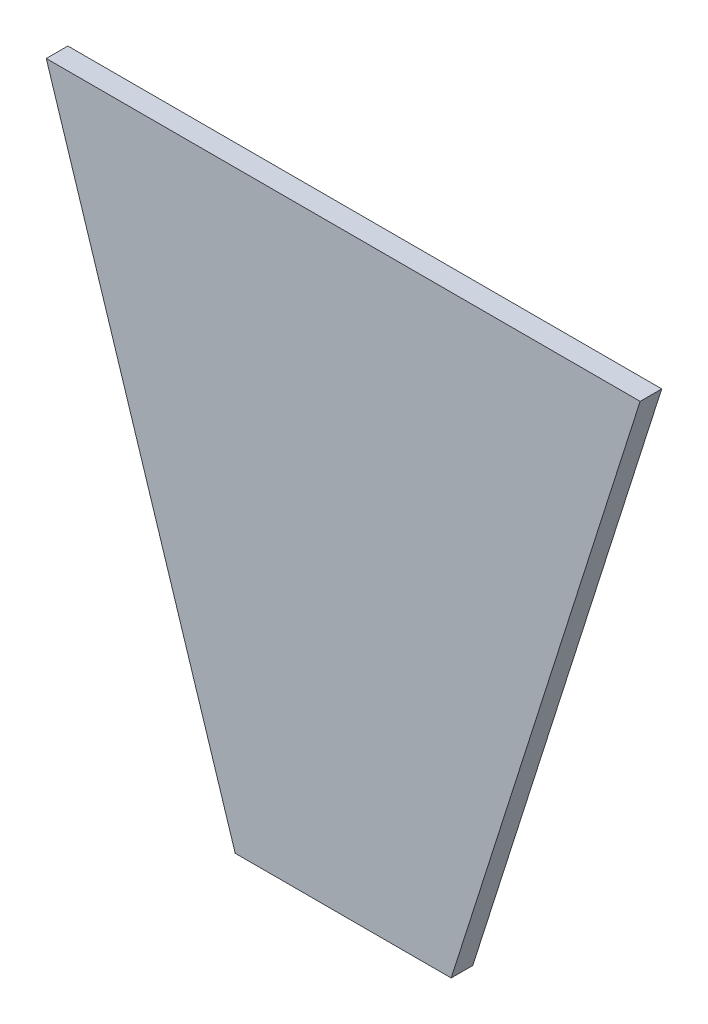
ISO-10303-21;
HEADER;
FILE_DESCRIPTION(('STEP AP214'),'2;1');
FILE_NAME('part.step','',(''),(''),'','','');
FILE_SCHEMA(('AUTOMOTIVE_DESIGN { 1 0 10303 214 1 1 1 1 }'));
ENDSEC;
DATA;
#1=APPLICATION_CONTEXT('core data for automotive mechanical design processes');
#2=APPLICATION_PROTOCOL_DEFINITION('international standard','automotive_design',2000,#1);
#3=PRODUCT_CONTEXT('',#1,'mechanical');
#4=PRODUCT('Part','Part','',(#3));
#5=PRODUCT_RELATED_PRODUCT_CATEGORY('part','',(#4));
#6=PRODUCT_DEFINITION_FORMATION('','',#4);
#7=PRODUCT_DEFINITION_CONTEXT('part definition',#1,'design');
#8=PRODUCT_DEFINITION('design','',#6,#7);
#9=PRODUCT_DEFINITION_SHAPE('','',#8);
#10=(LENGTH_UNIT() NAMED_UNIT(*) SI_UNIT(.MILLI.,.METRE.));
#11=(NAMED_UNIT(*) PLANE_ANGLE_UNIT() SI_UNIT($,.RADIAN.));
#12=(NAMED_UNIT(*) SI_UNIT($,.STERADIAN.) SOLID_ANGLE_UNIT());
#13=UNCERTAINTY_MEASURE_WITH_UNIT(LENGTH_MEASURE(1.E-05),#10,'distance_accuracy_value','');
#14=(GEOMETRIC_REPRESENTATION_CONTEXT(3) GLOBAL_UNCERTAINTY_ASSIGNED_CONTEXT((#13)) GLOBAL_UNIT_ASSIGNED_CONTEXT((#10,
#11,#12)) REPRESENTATION_CONTEXT('',''));
#15=CARTESIAN_POINT('',(0.,0.,0.));
#16=DIRECTION('',(0.,0.,1.));
#17=DIRECTION('',(1.,0.,0.));
#18=AXIS2_PLACEMENT_3D('',#15,#16,#17);
#19=CARTESIAN_POINT('',(70.,-220.,8.));
#20=DIRECTION('',(0.952925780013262,0.303203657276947,0.));
#21=DIRECTION('',(-0.303203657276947,0.952925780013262,0.));
#22=AXIS2_PLACEMENT_3D('',#19,#20,#21);
#23=PLANE('',#22);
#24=DIRECTION('',(0.303203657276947,-0.952925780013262,0.));
#25=VECTOR('',#24,1.);
#26=CARTESIAN_POINT('',(70.,-220.,0.));
#27=LINE('',#26,#25);
#28=CARTESIAN_POINT('',(0.,0.,0.));
#29=VERTEX_POINT('',#28);
#30=CARTESIAN_POINT('',(70.,-220.,0.));
#31=VERTEX_POINT('',#30);
#32=EDGE_CURVE('E73',#29,#31,#27,.T.);
#33=ORIENTED_EDGE('',*,*,#32,.T.);
#34=DIRECTION('',(0.,0.,-1.));
#35=VECTOR('',#34,1.);
#36=CARTESIAN_POINT('',(70.,-220.,8.));
#37=LINE('',#36,#35);
#38=CARTESIAN_POINT('',(70.,-220.,8.));
#39=VERTEX_POINT('',#38);
#40=EDGE_CURVE('E11',#39,#31,#37,.T.);
#41=ORIENTED_EDGE('',*,*,#40,.F.);
#42=DIRECTION('',(0.303203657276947,-0.952925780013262,0.));
#43=VECTOR('',#42,1.);
#44=CARTESIAN_POINT('',(70.,-220.,8.));
#45=LINE('',#44,#43);
#46=CARTESIAN_POINT('',(0.,0.,8.));
#47=VERTEX_POINT('',#46);
#48=EDGE_CURVE('E91',#47,#39,#45,.T.);
#49=ORIENTED_EDGE('',*,*,#48,.F.);
#50=DIRECTION('',(0.,0.,-1.));
#51=VECTOR('',#50,1.);
#52=CARTESIAN_POINT('',(0.,0.,8.));
#53=LINE('',#52,#51);
#54=EDGE_CURVE('E85',#47,#29,#53,.T.);
#55=ORIENTED_EDGE('',*,*,#54,.T.);
#56=EDGE_LOOP('',(#33,#41,#49,#55));
#57=FACE_BOUND('',#56,.T.);
#58=ADVANCED_FACE('F29',(#57),#23,.F.);
#59=CARTESIAN_POINT('',(150.,-220.,8.));
#60=DIRECTION('',(0.,1.,0.));
#61=DIRECTION('',(0.,0.,1.));
#62=AXIS2_PLACEMENT_3D('',#59,#60,#61);
#63=PLANE('',#62);
#64=DIRECTION('',(1.,0.,0.));
#65=VECTOR('',#64,1.);
#66=CARTESIAN_POINT('',(150.,-220.,0.));
#67=LINE('',#66,#65);
#68=CARTESIAN_POINT('',(150.,-220.,0.));
#69=VERTEX_POINT('',#68);
#70=EDGE_CURVE('E69',#31,#69,#67,.T.);
#71=ORIENTED_EDGE('',*,*,#70,.T.);
#72=DIRECTION('',(0.,0.,-1.));
#73=VECTOR('',#72,1.);
#74=CARTESIAN_POINT('',(150.,-220.,8.));
#75=LINE('',#74,#73);
#76=CARTESIAN_POINT('',(150.,-220.,8.));
#77=VERTEX_POINT('',#76);
#78=EDGE_CURVE('E36',#77,#69,#75,.T.);
#79=ORIENTED_EDGE('',*,*,#78,.F.);
#80=DIRECTION('',(1.,0.,0.));
#81=VECTOR('',#80,1.);
#82=CARTESIAN_POINT('',(150.,-220.,8.));
#83=LINE('',#82,#81);
#84=EDGE_CURVE('E81',#39,#77,#83,.T.);
#85=ORIENTED_EDGE('',*,*,#84,.F.);
#86=ORIENTED_EDGE('',*,*,#40,.T.);
#87=EDGE_LOOP('',(#71,#79,#85,#86));
#88=FACE_BOUND('',#87,.T.);
#89=ADVANCED_FACE('F80',(#88),#63,.F.);
#90=CARTESIAN_POINT('',(220.,0.,8.));
#91=DIRECTION('',(-0.952925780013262,0.303203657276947,0.));
#92=DIRECTION('',(-0.303203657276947,-0.952925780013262,0.));
#93=AXIS2_PLACEMENT_3D('',#90,#91,#92);
#94=PLANE('',#93);
#95=DIRECTION('',(0.303203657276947,0.952925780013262,0.));
#96=VECTOR('',#95,1.);
#97=CARTESIAN_POINT('',(220.,0.,0.));
#98=LINE('',#97,#96);
#99=CARTESIAN_POINT('',(220.,0.,0.));
#100=VERTEX_POINT('',#99);
#101=EDGE_CURVE('E74',#69,#100,#98,.T.);
#102=ORIENTED_EDGE('',*,*,#101,.T.);
#103=DIRECTION('',(0.,0.,-1.));
#104=VECTOR('',#103,1.);
#105=CARTESIAN_POINT('',(220.,0.,8.));
#106=LINE('',#105,#104);
#107=CARTESIAN_POINT('',(220.,0.,8.));
#108=VERTEX_POINT('',#107);
#109=EDGE_CURVE('E97',#108,#100,#106,.T.);
#110=ORIENTED_EDGE('',*,*,#109,.F.);
#111=DIRECTION('',(0.303203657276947,0.952925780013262,0.));
#112=VECTOR('',#111,1.);
#113=CARTESIAN_POINT('',(220.,0.,8.));
#114=LINE('',#113,#112);
#115=EDGE_CURVE('E48',#77,#108,#114,.T.);
#116=ORIENTED_EDGE('',*,*,#115,.F.);
#117=ORIENTED_EDGE('',*,*,#78,.T.);
#118=EDGE_LOOP('',(#102,#110,#116,#117));
#119=FACE_BOUND('',#118,.T.);
#120=ADVANCED_FACE('F100',(#119),#94,.F.);
#121=CARTESIAN_POINT('',(0.,0.,8.));
#122=DIRECTION('',(0.,-1.,0.));
#123=DIRECTION('',(0.,0.,-1.));
#124=AXIS2_PLACEMENT_3D('',#121,#122,#123);
#125=PLANE('',#124);
#126=DIRECTION('',(-1.,0.,0.));
#127=VECTOR('',#126,1.);
#128=CARTESIAN_POINT('',(0.,0.,0.));
#129=LINE('',#128,#127);
#130=EDGE_CURVE('E89',#100,#29,#129,.T.);
#131=ORIENTED_EDGE('',*,*,#130,.T.);
#132=ORIENTED_EDGE('',*,*,#54,.F.);
#133=DIRECTION('',(-1.,0.,0.));
#134=VECTOR('',#133,1.);
#135=CARTESIAN_POINT('',(0.,0.,8.));
#136=LINE('',#135,#134);
#137=EDGE_CURVE('E43',#108,#47,#136,.T.);
#138=ORIENTED_EDGE('',*,*,#137,.F.);
#139=ORIENTED_EDGE('',*,*,#109,.T.);
#140=EDGE_LOOP('',(#131,#132,#138,#139));
#141=FACE_BOUND('',#140,.T.);
#142=ADVANCED_FACE('F102',(#141),#125,.F.);
#143=CARTESIAN_POINT('',(0.,0.,8.));
#144=DIRECTION('',(0.,0.,-1.));
#145=DIRECTION('',(-1.,0.,0.));
#146=AXIS2_PLACEMENT_3D('',#143,#144,#145);
#147=PLANE('',#146);
#148=ORIENTED_EDGE('',*,*,#48,.T.);
#149=ORIENTED_EDGE('',*,*,#84,.T.);
#150=ORIENTED_EDGE('',*,*,#115,.T.);
#151=ORIENTED_EDGE('',*,*,#137,.T.);
#152=EDGE_LOOP('',(#148,#149,#150,#151));
#153=FACE_BOUND('',#152,.T.);
#154=ADVANCED_FACE('F103',(#153),#147,.F.);
#155=CARTESIAN_POINT('',(0.,0.,0.));
#156=DIRECTION('',(0.,0.,-1.));
#157=DIRECTION('',(-1.,0.,0.));
#158=AXIS2_PLACEMENT_3D('',#155,#156,#157);
#159=PLANE('',#158);
#160=ORIENTED_EDGE('',*,*,#32,.F.);
#161=ORIENTED_EDGE('',*,*,#130,.F.);
#162=ORIENTED_EDGE('',*,*,#101,.F.);
#163=ORIENTED_EDGE('',*,*,#70,.F.);
#164=EDGE_LOOP('',(#160,#161,#162,#163));
#165=FACE_BOUND('',#164,.T.);
#166=ADVANCED_FACE('F70',(#165),#159,.T.);
#167=CLOSED_SHELL('',(#58,#89,#120,#142,#154,#166));
#168=MANIFOLD_SOLID_BREP('B2',#167);
#169=ADVANCED_BREP_SHAPE_REPRESENTATION('',(#18,#168),#14);
#170=SHAPE_DEFINITION_REPRESENTATION(#9,#169);
ENDSEC;
END-ISO-10303-21;
